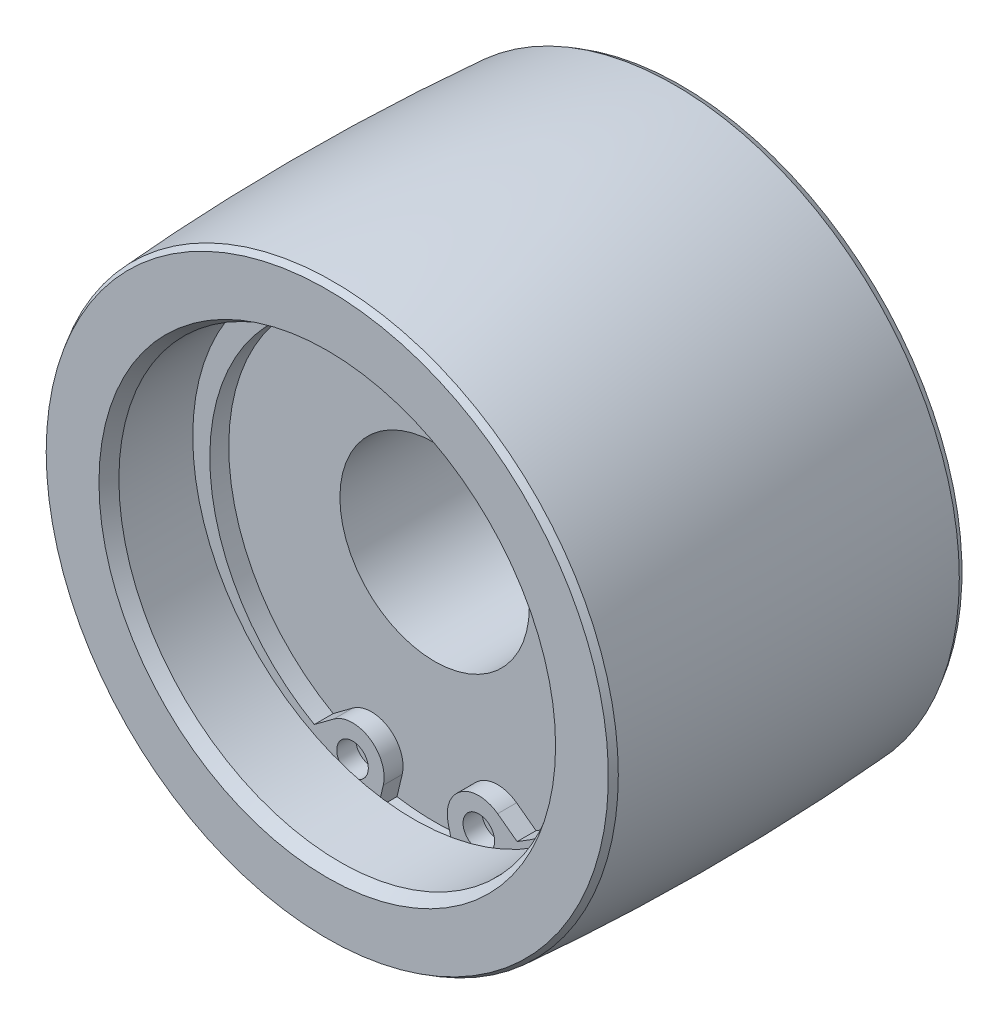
ISO-10303-21;
HEADER;
FILE_DESCRIPTION(('STEP AP214'),'2;1');
FILE_NAME('part.step','',(''),(''),'','','');
FILE_SCHEMA(('AUTOMOTIVE_DESIGN { 1 0 10303 214 1 1 1 1 }'));
ENDSEC;
DATA;
#1=APPLICATION_CONTEXT('core data for automotive mechanical design processes');
#2=APPLICATION_PROTOCOL_DEFINITION('international standard','automotive_design',2000,#1);
#3=PRODUCT_CONTEXT('',#1,'mechanical');
#4=PRODUCT('Part','Part','',(#3));
#5=PRODUCT_RELATED_PRODUCT_CATEGORY('part','',(#4));
#6=PRODUCT_DEFINITION_FORMATION('','',#4);
#7=PRODUCT_DEFINITION_CONTEXT('part definition',#1,'design');
#8=PRODUCT_DEFINITION('design','',#6,#7);
#9=PRODUCT_DEFINITION_SHAPE('','',#8);
#10=(LENGTH_UNIT() NAMED_UNIT(*) SI_UNIT(.MILLI.,.METRE.));
#11=(NAMED_UNIT(*) PLANE_ANGLE_UNIT() SI_UNIT($,.RADIAN.));
#12=(NAMED_UNIT(*) SI_UNIT($,.STERADIAN.) SOLID_ANGLE_UNIT());
#13=UNCERTAINTY_MEASURE_WITH_UNIT(LENGTH_MEASURE(1.E-05),#10,'distance_accuracy_value','');
#14=(GEOMETRIC_REPRESENTATION_CONTEXT(3) GLOBAL_UNCERTAINTY_ASSIGNED_CONTEXT((#13)) GLOBAL_UNIT_ASSIGNED_CONTEXT((#10,
#11,#12)) REPRESENTATION_CONTEXT('',''));
#15=CARTESIAN_POINT('',(0.,0.,0.));
#16=DIRECTION('',(0.,0.,1.));
#17=DIRECTION('',(1.,0.,0.));
#18=AXIS2_PLACEMENT_3D('',#15,#16,#17);
#19=CARTESIAN_POINT('',(0.,-0.9,7.1));
#20=DIRECTION('',(0.,0.,1.));
#21=DIRECTION('',(-1.,0.,0.));
#22=AXIS2_PLACEMENT_3D('',#19,#20,#21);
#23=CYLINDRICAL_SURFACE('',#22,16.3);
#24=CARTESIAN_POINT('',(0.,-0.9,7.));
#25=DIRECTION('',(0.,0.,1.));
#26=DIRECTION('',(1.,0.,0.));
#27=AXIS2_PLACEMENT_3D('',#24,#25,#26);
#28=CIRCLE('',#27,16.3);
#29=CARTESIAN_POINT('',(-8.02922574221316,-15.0852576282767,7.));
#30=VERTEX_POINT('',#29);
#31=CARTESIAN_POINT('',(8.02922574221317,-15.0852576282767,7.));
#32=VERTEX_POINT('',#31);
#33=EDGE_CURVE('E212',#30,#32,#28,.F.);
#34=ORIENTED_EDGE('',*,*,#33,.F.);
#35=DIRECTION('',(0.,0.,-1.));
#36=VECTOR('',#35,1.);
#37=CARTESIAN_POINT('',(-8.02922574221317,-15.0852576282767,7.1));
#38=LINE('',#37,#36);
#39=CARTESIAN_POINT('',(-8.02922574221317,-15.0852576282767,5.5));
#40=VERTEX_POINT('',#39);
#41=EDGE_CURVE('E168',#30,#40,#38,.T.);
#42=ORIENTED_EDGE('',*,*,#41,.T.);
#43=CARTESIAN_POINT('',(0.,-0.9,5.5));
#44=DIRECTION('',(0.,0.,-1.));
#45=DIRECTION('',(0.,-1.,0.));
#46=AXIS2_PLACEMENT_3D('',#43,#44,#45);
#47=CIRCLE('',#46,16.3);
#48=CARTESIAN_POINT('',(8.02922574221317,-15.0852576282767,5.5));
#49=VERTEX_POINT('',#48);
#50=EDGE_CURVE('E171',#40,#49,#47,.T.);
#51=ORIENTED_EDGE('',*,*,#50,.T.);
#52=DIRECTION('',(0.,0.,-1.));
#53=VECTOR('',#52,1.);
#54=CARTESIAN_POINT('',(8.02922574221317,-15.0852576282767,7.1));
#55=LINE('',#54,#53);
#56=EDGE_CURVE('E164',#32,#49,#55,.T.);
#57=ORIENTED_EDGE('',*,*,#56,.F.);
#58=EDGE_LOOP('',(#34,#42,#51,#57));
#59=FACE_BOUND('',#58,.T.);
#60=ADVANCED_FACE('F14',(#59),#23,.F.);
#61=CARTESIAN_POINT('',(6.49138441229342,-13.9421779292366,7.1));
#62=DIRECTION('',(-0.596553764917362,-0.802573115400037,0.));
#63=DIRECTION('',(-0.802573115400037,0.596553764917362,0.));
#64=AXIS2_PLACEMENT_3D('',#61,#62,#63);
#65=PLANE('',#64);
#66=DIRECTION('',(-0.802573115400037,0.596553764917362,0.));
#67=VECTOR('',#66,1.);
#68=CARTESIAN_POINT('',(6.49138441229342,-13.9421779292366,7.));
#69=LINE('',#68,#67);
#70=CARTESIAN_POINT('',(6.49138441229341,-13.9421779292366,7.));
#71=VERTEX_POINT('',#70);
#72=EDGE_CURVE('E210',#32,#71,#69,.T.);
#73=ORIENTED_EDGE('',*,*,#72,.F.);
#74=ORIENTED_EDGE('',*,*,#56,.T.);
#75=DIRECTION('',(-0.802573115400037,0.596553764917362,0.));
#76=VECTOR('',#75,1.);
#77=CARTESIAN_POINT('',(6.49138441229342,-13.9421779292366,5.5));
#78=LINE('',#77,#76);
#79=CARTESIAN_POINT('',(6.49138441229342,-13.9421779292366,5.5));
#80=VERTEX_POINT('',#79);
#81=EDGE_CURVE('E167',#49,#80,#78,.T.);
#82=ORIENTED_EDGE('',*,*,#81,.T.);
#83=DIRECTION('',(0.,0.,-1.));
#84=VECTOR('',#83,1.);
#85=CARTESIAN_POINT('',(6.49138441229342,-13.9421779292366,7.1));
#86=LINE('',#85,#84);
#87=EDGE_CURVE('E162',#71,#80,#86,.T.);
#88=ORIENTED_EDGE('',*,*,#87,.F.);
#89=EDGE_LOOP('',(#73,#74,#82,#88));
#90=FACE_BOUND('',#89,.T.);
#91=ADVANCED_FACE('F194',(#90),#65,.F.);
#92=CARTESIAN_POINT('',(5.,-15.9486107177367,7.1));
#93=DIRECTION('',(0.,0.,1.));
#94=DIRECTION('',(-1.,0.,0.));
#95=AXIS2_PLACEMENT_3D('',#92,#93,#94);
#96=CYLINDRICAL_SURFACE('',#95,2.5);
#97=DIRECTION('',(0.,0.,-1.));
#98=VECTOR('',#97,1.);
#99=CARTESIAN_POINT('',(2.5678231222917,-16.526983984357,7.1));
#100=LINE('',#99,#98);
#101=CARTESIAN_POINT('',(2.5678231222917,-16.526983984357,7.));
#102=VERTEX_POINT('',#101);
#103=CARTESIAN_POINT('',(2.5678231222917,-16.526983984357,5.5));
#104=VERTEX_POINT('',#103);
#105=EDGE_CURVE('E174',#102,#104,#100,.T.);
#106=ORIENTED_EDGE('',*,*,#105,.F.);
#107=CARTESIAN_POINT('',(5.,-15.9486107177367,7.));
#108=DIRECTION('',(0.,0.,1.));
#109=DIRECTION('',(1.,0.,0.));
#110=AXIS2_PLACEMENT_3D('',#107,#108,#109);
#111=CIRCLE('',#110,2.5);
#112=EDGE_CURVE('E209',#102,#71,#111,.F.);
#113=ORIENTED_EDGE('',*,*,#112,.T.);
#114=ORIENTED_EDGE('',*,*,#87,.T.);
#115=CARTESIAN_POINT('',(5.,-15.9486107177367,5.5));
#116=DIRECTION('',(0.,0.,1.));
#117=DIRECTION('',(1.,0.,0.));
#118=AXIS2_PLACEMENT_3D('',#115,#116,#117);
#119=CIRCLE('',#118,2.5);
#120=EDGE_CURVE('E113',#80,#104,#119,.T.);
#121=ORIENTED_EDGE('',*,*,#120,.T.);
#122=EDGE_LOOP('',(#106,#113,#114,#121));
#123=FACE_BOUND('',#122,.T.);
#124=ADVANCED_FACE('F208',(#123),#96,.T.);
#125=CARTESIAN_POINT('',(-2.56782312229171,-16.526983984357,7.1));
#126=DIRECTION('',(-0.97287075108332,0.231349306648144,0.));
#127=DIRECTION('',(0.,0.,1.));
#128=AXIS2_PLACEMENT_3D('',#125,#126,#127);
#129=PLANE('',#128);
#130=DIRECTION('',(0.231349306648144,0.97287075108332,0.));
#131=VECTOR('',#130,1.);
#132=CARTESIAN_POINT('',(-2.56782312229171,-16.526983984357,7.));
#133=LINE('',#132,#131);
#134=CARTESIAN_POINT('',(-2.97957431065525,-18.2584812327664,7.));
#135=VERTEX_POINT('',#134);
#136=CARTESIAN_POINT('',(-2.5678231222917,-16.526983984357,7.));
#137=VERTEX_POINT('',#136);
#138=EDGE_CURVE('E89',#135,#137,#133,.T.);
#139=ORIENTED_EDGE('',*,*,#138,.F.);
#140=DIRECTION('',(0.,0.,-1.));
#141=VECTOR('',#140,1.);
#142=CARTESIAN_POINT('',(-2.97957431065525,-18.2584812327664,-15.4));
#143=LINE('',#142,#141);
#144=CARTESIAN_POINT('',(-2.97957431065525,-18.2584812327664,5.5));
#145=VERTEX_POINT('',#144);
#146=EDGE_CURVE('E22',#145,#135,#143,.F.);
#147=ORIENTED_EDGE('',*,*,#146,.F.);
#148=DIRECTION('',(0.231349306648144,0.97287075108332,0.));
#149=VECTOR('',#148,1.);
#150=CARTESIAN_POINT('',(-2.56782312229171,-16.526983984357,5.5));
#151=LINE('',#150,#149);
#152=CARTESIAN_POINT('',(-2.56782312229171,-16.526983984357,5.5));
#153=VERTEX_POINT('',#152);
#154=EDGE_CURVE('E35',#145,#153,#151,.T.);
#155=ORIENTED_EDGE('',*,*,#154,.T.);
#156=DIRECTION('',(0.,0.,-1.));
#157=VECTOR('',#156,1.);
#158=CARTESIAN_POINT('',(-2.56782312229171,-16.526983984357,7.1));
#159=LINE('',#158,#157);
#160=EDGE_CURVE('E99',#137,#153,#159,.T.);
#161=ORIENTED_EDGE('',*,*,#160,.F.);
#162=EDGE_LOOP('',(#139,#147,#155,#161));
#163=FACE_BOUND('',#162,.T.);
#164=ADVANCED_FACE('F98',(#163),#129,.F.);
#165=CARTESIAN_POINT('',(-6.49138441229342,-13.9421779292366,7.1));
#166=DIRECTION('',(0.596553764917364,-0.802573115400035,0.));
#167=DIRECTION('',(0.,0.,-1.));
#168=AXIS2_PLACEMENT_3D('',#165,#166,#167);
#169=PLANE('',#168);
#170=DIRECTION('',(-0.802573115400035,-0.596553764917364,0.));
#171=VECTOR('',#170,1.);
#172=CARTESIAN_POINT('',(-6.49138441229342,-13.9421779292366,7.));
#173=LINE('',#172,#171);
#174=CARTESIAN_POINT('',(-6.49138441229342,-13.9421779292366,7.));
#175=VERTEX_POINT('',#174);
#176=EDGE_CURVE('E217',#175,#30,#173,.T.);
#177=ORIENTED_EDGE('',*,*,#176,.F.);
#178=DIRECTION('',(0.,0.,-1.));
#179=VECTOR('',#178,1.);
#180=CARTESIAN_POINT('',(-6.49138441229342,-13.9421779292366,7.1));
#181=LINE('',#180,#179);
#182=CARTESIAN_POINT('',(-6.49138441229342,-13.9421779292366,5.5));
#183=VERTEX_POINT('',#182);
#184=EDGE_CURVE('E109',#175,#183,#181,.T.);
#185=ORIENTED_EDGE('',*,*,#184,.T.);
#186=DIRECTION('',(-0.802573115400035,-0.596553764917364,0.));
#187=VECTOR('',#186,1.);
#188=CARTESIAN_POINT('',(-6.49138441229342,-13.9421779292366,5.5));
#189=LINE('',#188,#187);
#190=EDGE_CURVE('E105',#183,#40,#189,.T.);
#191=ORIENTED_EDGE('',*,*,#190,.T.);
#192=ORIENTED_EDGE('',*,*,#41,.F.);
#193=EDGE_LOOP('',(#177,#185,#191,#192));
#194=FACE_BOUND('',#193,.T.);
#195=ADVANCED_FACE('F232',(#194),#169,.F.);
#196=CARTESIAN_POINT('',(-5.,-15.9486107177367,7.1));
#197=DIRECTION('',(0.,0.,1.));
#198=DIRECTION('',(-1.,0.,0.));
#199=AXIS2_PLACEMENT_3D('',#196,#197,#198);
#200=CYLINDRICAL_SURFACE('',#199,2.5);
#201=ORIENTED_EDGE('',*,*,#184,.F.);
#202=CARTESIAN_POINT('',(-5.,-15.9486107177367,7.));
#203=DIRECTION('',(0.,0.,1.));
#204=DIRECTION('',(1.,0.,0.));
#205=AXIS2_PLACEMENT_3D('',#202,#203,#204);
#206=CIRCLE('',#205,2.5);
#207=EDGE_CURVE('E101',#175,#137,#206,.F.);
#208=ORIENTED_EDGE('',*,*,#207,.T.);
#209=ORIENTED_EDGE('',*,*,#160,.T.);
#210=CARTESIAN_POINT('',(-5.,-15.9486107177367,5.5));
#211=DIRECTION('',(0.,0.,1.));
#212=DIRECTION('',(-1.,0.,0.));
#213=AXIS2_PLACEMENT_3D('',#210,#211,#212);
#214=CIRCLE('',#213,2.5);
#215=EDGE_CURVE('E158',#153,#183,#214,.T.);
#216=ORIENTED_EDGE('',*,*,#215,.T.);
#217=EDGE_LOOP('',(#201,#208,#209,#216));
#218=FACE_BOUND('',#217,.T.);
#219=ADVANCED_FACE('F235',(#218),#200,.T.);
#220=CARTESIAN_POINT('',(2.5678231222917,-16.526983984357,7.1));
#221=DIRECTION('',(0.972870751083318,0.231349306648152,0.));
#222=DIRECTION('',(0.,0.,-1.));
#223=AXIS2_PLACEMENT_3D('',#220,#221,#222);
#224=PLANE('',#223);
#225=DIRECTION('',(0.231349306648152,-0.972870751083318,0.));
#226=VECTOR('',#225,1.);
#227=CARTESIAN_POINT('',(2.5678231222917,-16.526983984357,7.));
#228=LINE('',#227,#226);
#229=CARTESIAN_POINT('',(2.97957431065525,-18.2584812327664,7.));
#230=VERTEX_POINT('',#229);
#231=EDGE_CURVE('E92',#102,#230,#228,.T.);
#232=ORIENTED_EDGE('',*,*,#231,.F.);
#233=ORIENTED_EDGE('',*,*,#105,.T.);
#234=DIRECTION('',(0.231349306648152,-0.972870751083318,0.));
#235=VECTOR('',#234,1.);
#236=CARTESIAN_POINT('',(2.5678231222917,-16.526983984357,5.5));
#237=LINE('',#236,#235);
#238=CARTESIAN_POINT('',(2.97957431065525,-18.2584812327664,5.5));
#239=VERTEX_POINT('',#238);
#240=EDGE_CURVE('E172',#104,#239,#237,.T.);
#241=ORIENTED_EDGE('',*,*,#240,.T.);
#242=DIRECTION('',(0.,0.,-1.));
#243=VECTOR('',#242,1.);
#244=CARTESIAN_POINT('',(2.97957431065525,-18.2584812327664,-15.4));
#245=LINE('',#244,#243);
#246=EDGE_CURVE('E9',#230,#239,#245,.T.);
#247=ORIENTED_EDGE('',*,*,#246,.F.);
#248=EDGE_LOOP('',(#232,#233,#241,#247));
#249=FACE_BOUND('',#248,.T.);
#250=ADVANCED_FACE('F237',(#249),#224,.F.);
#251=CARTESIAN_POINT('',(0.,0.,0.));
#252=DIRECTION('',(0.,0.,-1.));
#253=DIRECTION('',(-1.,0.,0.));
#254=AXIS2_PLACEMENT_3D('',#251,#252,#253);
#255=DEGENERATE_TOROIDAL_SURFACE('',#254,177.,200.,.F.);
#256=CARTESIAN_POINT('',(0.,0.,-13.4999999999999));
#257=DIRECTION('',(0.,0.,-1.));
#258=DIRECTION('',(-1.,0.,0.));
#259=AXIS2_PLACEMENT_3D('',#256,#257,#258);
#260=CIRCLE('',#259,22.5438548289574);
#261=CARTESIAN_POINT('',(-22.5438548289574,0.,-13.4999999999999));
#262=VERTEX_POINT('',#261);
#263=EDGE_CURVE('E115',#262,#262,#260,.F.);
#264=ORIENTED_EDGE('',*,*,#263,.T.);
#265=EDGE_LOOP('',(#264));
#266=FACE_BOUND('',#265,.T.);
#267=CARTESIAN_POINT('',(0.,0.,13.5));
#268=DIRECTION('',(0.,0.,1.));
#269=DIRECTION('',(1.,0.,0.));
#270=AXIS2_PLACEMENT_3D('',#267,#268,#269);
#271=CIRCLE('',#270,22.5438548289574);
#272=CARTESIAN_POINT('',(22.5438548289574,0.,13.5));
#273=VERTEX_POINT('',#272);
#274=EDGE_CURVE('E120',#273,#273,#271,.F.);
#275=ORIENTED_EDGE('',*,*,#274,.T.);
#276=EDGE_LOOP('',(#275));
#277=FACE_BOUND('',#276,.T.);
#278=ADVANCED_FACE('F244',(#266,#277),#255,.F.);
#279=CARTESIAN_POINT('',(0.,0.,14.));
#280=DIRECTION('',(0.,0.,-1.));
#281=DIRECTION('',(-1.,0.,0.));
#282=AXIS2_PLACEMENT_3D('',#279,#280,#281);
#283=CONICAL_SURFACE('',#282,22.2551796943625,0.523598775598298);
#284=CARTESIAN_POINT('',(0.,0.,14.));
#285=DIRECTION('',(0.,0.,-1.));
#286=DIRECTION('',(-1.,0.,0.));
#287=AXIS2_PLACEMENT_3D('',#284,#285,#286);
#288=CIRCLE('',#287,22.2551796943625);
#289=CARTESIAN_POINT('',(-22.2551796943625,0.,14.));
#290=VERTEX_POINT('',#289);
#291=EDGE_CURVE('E119',#290,#290,#288,.T.);
#292=ORIENTED_EDGE('',*,*,#291,.T.);
#293=EDGE_LOOP('',(#292));
#294=FACE_BOUND('',#293,.T.);
#295=ORIENTED_EDGE('',*,*,#274,.F.);
#296=EDGE_LOOP('',(#295));
#297=FACE_BOUND('',#296,.T.);
#298=ADVANCED_FACE('F331',(#294,#297),#283,.T.);
#299=CARTESIAN_POINT('',(0.,0.,-13.));
#300=DIRECTION('',(0.,0.,1.));
#301=DIRECTION('',(1.,0.,0.));
#302=AXIS2_PLACEMENT_3D('',#299,#300,#301);
#303=CONICAL_SURFACE('',#302,22.8325299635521,0.523598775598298);
#304=CARTESIAN_POINT('',(0.,0.,-14.));
#305=DIRECTION('',(0.,0.,-1.));
#306=DIRECTION('',(-1.,0.,0.));
#307=AXIS2_PLACEMENT_3D('',#304,#305,#306);
#308=CIRCLE('',#307,22.2551796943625);
#309=CARTESIAN_POINT('',(-22.2551796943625,0.,-14.));
#310=VERTEX_POINT('',#309);
#311=EDGE_CURVE('E118',#310,#310,#308,.T.);
#312=ORIENTED_EDGE('',*,*,#311,.F.);
#313=EDGE_LOOP('',(#312));
#314=FACE_BOUND('',#313,.T.);
#315=ORIENTED_EDGE('',*,*,#263,.F.);
#316=EDGE_LOOP('',(#315));
#317=FACE_BOUND('',#316,.T.);
#318=ADVANCED_FACE('F341',(#314,#317),#303,.T.);
#319=CARTESIAN_POINT('',(0.,0.,14.));
#320=DIRECTION('',(0.,0.,1.));
#321=DIRECTION('',(1.,0.,0.));
#322=AXIS2_PLACEMENT_3D('',#319,#320,#321);
#323=PLANE('',#322);
#324=ORIENTED_EDGE('',*,*,#291,.F.);
#325=EDGE_LOOP('',(#324));
#326=FACE_BOUND('',#325,.T.);
#327=CARTESIAN_POINT('',(0.,0.,14.));
#328=DIRECTION('',(0.,0.,-1.));
#329=DIRECTION('',(-1.,0.,0.));
#330=AXIS2_PLACEMENT_3D('',#327,#328,#329);
#331=CIRCLE('',#330,18.0773502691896);
#332=CARTESIAN_POINT('',(-18.0773502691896,0.,14.));
#333=VERTEX_POINT('',#332);
#334=EDGE_CURVE('E123',#333,#333,#331,.T.);
#335=ORIENTED_EDGE('',*,*,#334,.T.);
#336=EDGE_LOOP('',(#335));
#337=FACE_BOUND('',#336,.T.);
#338=ADVANCED_FACE('F351',(#326,#337),#323,.T.);
#339=CARTESIAN_POINT('',(0.,0.,-14.));
#340=DIRECTION('',(0.,0.,1.));
#341=DIRECTION('',(1.,0.,0.));
#342=AXIS2_PLACEMENT_3D('',#339,#340,#341);
#343=PLANE('',#342);
#344=ORIENTED_EDGE('',*,*,#311,.T.);
#345=EDGE_LOOP('',(#344));
#346=FACE_BOUND('',#345,.T.);
#347=CARTESIAN_POINT('',(0.,0.,-14.));
#348=DIRECTION('',(0.,0.,-1.));
#349=DIRECTION('',(-1.,0.,0.));
#350=AXIS2_PLACEMENT_3D('',#347,#348,#349);
#351=CIRCLE('',#350,14.5);
#352=CARTESIAN_POINT('',(-14.5,0.,-14.));
#353=VERTEX_POINT('',#352);
#354=EDGE_CURVE('E124',#353,#353,#351,.T.);
#355=ORIENTED_EDGE('',*,*,#354,.F.);
#356=EDGE_LOOP('',(#355));
#357=FACE_BOUND('',#356,.T.);
#358=ADVANCED_FACE('F361',(#346,#357),#343,.F.);
#359=CARTESIAN_POINT('',(0.,0.,13.));
#360=DIRECTION('',(0.,0.,1.));
#361=DIRECTION('',(1.,0.,0.));
#362=AXIS2_PLACEMENT_3D('',#359,#360,#361);
#363=CONICAL_SURFACE('',#362,17.5,0.523598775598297);
#364=ORIENTED_EDGE('',*,*,#334,.F.);
#365=EDGE_LOOP('',(#364));
#366=FACE_BOUND('',#365,.T.);
#367=CARTESIAN_POINT('',(0.,0.,13.));
#368=DIRECTION('',(0.,0.,-1.));
#369=DIRECTION('',(-1.,0.,0.));
#370=AXIS2_PLACEMENT_3D('',#367,#368,#369);
#371=CIRCLE('',#370,17.5);
#372=CARTESIAN_POINT('',(-17.5,0.,13.));
#373=VERTEX_POINT('',#372);
#374=EDGE_CURVE('E129',#373,#373,#371,.T.);
#375=ORIENTED_EDGE('',*,*,#374,.T.);
#376=EDGE_LOOP('',(#375));
#377=FACE_BOUND('',#376,.T.);
#378=ADVANCED_FACE('F371',(#366,#377),#363,.F.);
#379=CARTESIAN_POINT('',(0.,0.,-15.4));
#380=DIRECTION('',(0.,0.,-1.));
#381=DIRECTION('',(-1.,0.,0.));
#382=AXIS2_PLACEMENT_3D('',#379,#380,#381);
#383=CYLINDRICAL_SURFACE('',#382,14.5);
#384=CARTESIAN_POINT('',(0.,0.,-5.5));
#385=DIRECTION('',(0.,0.,1.));
#386=DIRECTION('',(1.,0.,0.));
#387=AXIS2_PLACEMENT_3D('',#384,#385,#386);
#388=CIRCLE('',#387,14.5);
#389=CARTESIAN_POINT('',(14.5,0.,-5.5));
#390=VERTEX_POINT('',#389);
#391=EDGE_CURVE('E127',#390,#390,#388,.T.);
#392=ORIENTED_EDGE('',*,*,#391,.T.);
#393=EDGE_LOOP('',(#392));
#394=FACE_BOUND('',#393,.T.);
#395=ORIENTED_EDGE('',*,*,#354,.T.);
#396=EDGE_LOOP('',(#395));
#397=FACE_BOUND('',#396,.T.);
#398=ADVANCED_FACE('F380',(#394,#397),#383,.F.);
#399=CARTESIAN_POINT('',(0.,0.,-15.4));
#400=DIRECTION('',(0.,0.,-1.));
#401=DIRECTION('',(-1.,0.,0.));
#402=AXIS2_PLACEMENT_3D('',#399,#400,#401);
#403=CYLINDRICAL_SURFACE('',#402,17.5);
#404=ORIENTED_EDGE('',*,*,#374,.F.);
#405=EDGE_LOOP('',(#404));
#406=FACE_BOUND('',#405,.T.);
#407=CARTESIAN_POINT('',(0.,0.,7.15));
#408=DIRECTION('',(0.,0.,-1.));
#409=DIRECTION('',(-1.,0.,0.));
#410=AXIS2_PLACEMENT_3D('',#407,#408,#409);
#411=CIRCLE('',#410,17.5);
#412=CARTESIAN_POINT('',(-17.5,0.,7.15));
#413=VERTEX_POINT('',#412);
#414=EDGE_CURVE('E478',#413,#413,#411,.T.);
#415=ORIENTED_EDGE('',*,*,#414,.T.);
#416=EDGE_LOOP('',(#415));
#417=FACE_BOUND('',#416,.T.);
#418=ADVANCED_FACE('F390',(#406,#417),#403,.F.);
#419=CARTESIAN_POINT('',(0.,8.13513866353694,-5.5));
#420=DIRECTION('',(0.,0.,-1.));
#421=DIRECTION('',(-1.,0.,0.));
#422=AXIS2_PLACEMENT_3D('',#419,#420,#421);
#423=PLANE('',#422);
#424=CARTESIAN_POINT('',(0.,0.,-5.5));
#425=DIRECTION('',(0.,0.,1.));
#426=DIRECTION('',(1.,0.,0.));
#427=AXIS2_PLACEMENT_3D('',#424,#425,#426);
#428=CIRCLE('',#427,7.5);
#429=CARTESIAN_POINT('',(7.5,0.,-5.5));
#430=VERTEX_POINT('',#429);
#431=EDGE_CURVE('E143',#430,#430,#428,.T.);
#432=ORIENTED_EDGE('',*,*,#431,.T.);
#433=EDGE_LOOP('',(#432));
#434=FACE_BOUND('',#433,.T.);
#435=ORIENTED_EDGE('',*,*,#391,.F.);
#436=EDGE_LOOP('',(#435));
#437=FACE_BOUND('',#436,.T.);
#438=ADVANCED_FACE('F401',(#434,#437),#423,.T.);
#439=CARTESIAN_POINT('',(0.,0.,-15.4));
#440=DIRECTION('',(0.,0.,-1.));
#441=DIRECTION('',(-1.,0.,0.));
#442=AXIS2_PLACEMENT_3D('',#439,#440,#441);
#443=CYLINDRICAL_SURFACE('',#442,18.5);
#444=CARTESIAN_POINT('',(0.,0.,7.15));
#445=DIRECTION('',(0.,0.,-1.));
#446=DIRECTION('',(-1.,0.,0.));
#447=AXIS2_PLACEMENT_3D('',#444,#445,#446);
#448=CIRCLE('',#447,18.5);
#449=CARTESIAN_POINT('',(-18.5,0.,7.15));
#450=VERTEX_POINT('',#449);
#451=EDGE_CURVE('E94',#450,#450,#448,.T.);
#452=ORIENTED_EDGE('',*,*,#451,.F.);
#453=EDGE_LOOP('',(#452));
#454=FACE_BOUND('',#453,.T.);
#455=CARTESIAN_POINT('',(0.,0.,7.));
#456=DIRECTION('',(0.,0.,1.));
#457=DIRECTION('',(1.,0.,0.));
#458=AXIS2_PLACEMENT_3D('',#455,#456,#457);
#459=CIRCLE('',#458,18.5);
#460=EDGE_CURVE('E85',#230,#135,#459,.T.);
#461=ORIENTED_EDGE('',*,*,#460,.F.);
#462=ORIENTED_EDGE('',*,*,#246,.T.);
#463=CARTESIAN_POINT('',(0.,0.,5.5));
#464=DIRECTION('',(0.,0.,-1.));
#465=DIRECTION('',(-1.,0.,0.));
#466=AXIS2_PLACEMENT_3D('',#463,#464,#465);
#467=CIRCLE('',#466,18.5);
#468=EDGE_CURVE('E104',#239,#145,#467,.T.);
#469=ORIENTED_EDGE('',*,*,#468,.T.);
#470=ORIENTED_EDGE('',*,*,#146,.T.);
#471=EDGE_LOOP('',(#461,#462,#469,#470));
#472=FACE_BOUND('',#471,.T.);
#473=ADVANCED_FACE('F103',(#454,#472),#443,.F.);
#474=CARTESIAN_POINT('',(0.,0.,-44.5));
#475=DIRECTION('',(0.,0.,1.));
#476=DIRECTION('',(1.,0.,0.));
#477=AXIS2_PLACEMENT_3D('',#474,#475,#476);
#478=CYLINDRICAL_SURFACE('',#477,7.5);
#479=ORIENTED_EDGE('',*,*,#431,.F.);
#480=EDGE_LOOP('',(#479));
#481=FACE_BOUND('',#480,.T.);
#482=CARTESIAN_POINT('',(0.,0.,5.5));
#483=DIRECTION('',(0.,0.,1.));
#484=DIRECTION('',(1.,0.,0.));
#485=AXIS2_PLACEMENT_3D('',#482,#483,#484);
#486=CIRCLE('',#485,7.5);
#487=CARTESIAN_POINT('',(7.5,0.,5.5));
#488=VERTEX_POINT('',#487);
#489=EDGE_CURVE('E138',#488,#488,#486,.T.);
#490=ORIENTED_EDGE('',*,*,#489,.T.);
#491=EDGE_LOOP('',(#490));
#492=FACE_BOUND('',#491,.T.);
#493=ADVANCED_FACE('F284',(#481,#492),#478,.F.);
#494=CARTESIAN_POINT('',(0.,20.1822231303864,5.5));
#495=DIRECTION('',(0.,0.,1.));
#496=DIRECTION('',(1.,0.,0.));
#497=AXIS2_PLACEMENT_3D('',#494,#495,#496);
#498=PLANE('',#497);
#499=ORIENTED_EDGE('',*,*,#489,.F.);
#500=EDGE_LOOP('',(#499));
#501=FACE_BOUND('',#500,.T.);
#502=ORIENTED_EDGE('',*,*,#240,.F.);
#503=ORIENTED_EDGE('',*,*,#120,.F.);
#504=ORIENTED_EDGE('',*,*,#81,.F.);
#505=ORIENTED_EDGE('',*,*,#50,.F.);
#506=ORIENTED_EDGE('',*,*,#190,.F.);
#507=ORIENTED_EDGE('',*,*,#215,.F.);
#508=ORIENTED_EDGE('',*,*,#154,.F.);
#509=ORIENTED_EDGE('',*,*,#468,.F.);
#510=EDGE_LOOP('',(#502,#503,#504,#505,#506,#507,#508,#509));
#511=FACE_BOUND('',#510,.T.);
#512=ADVANCED_FACE('F16',(#501,#511),#498,.T.);
#513=CARTESIAN_POINT('',(0.,0.,7.));
#514=DIRECTION('',(0.,0.,1.));
#515=DIRECTION('',(1.,0.,0.));
#516=AXIS2_PLACEMENT_3D('',#513,#514,#515);
#517=PLANE('',#516);
#518=ORIENTED_EDGE('',*,*,#138,.T.);
#519=ORIENTED_EDGE('',*,*,#207,.F.);
#520=ORIENTED_EDGE('',*,*,#176,.T.);
#521=ORIENTED_EDGE('',*,*,#33,.T.);
#522=ORIENTED_EDGE('',*,*,#72,.T.);
#523=ORIENTED_EDGE('',*,*,#112,.F.);
#524=ORIENTED_EDGE('',*,*,#231,.T.);
#525=ORIENTED_EDGE('',*,*,#460,.T.);
#526=EDGE_LOOP('',(#518,#519,#520,#521,#522,#523,#524,#525));
#527=FACE_BOUND('',#526,.T.);
#528=CARTESIAN_POINT('',(-5.,-15.9486107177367,7.));
#529=DIRECTION('',(0.,0.,1.));
#530=DIRECTION('',(1.,0.,0.));
#531=AXIS2_PLACEMENT_3D('',#528,#529,#530);
#532=CIRCLE('',#531,1.25);
#533=CARTESIAN_POINT('',(-3.75,-15.9486107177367,7.));
#534=VERTEX_POINT('',#533);
#535=EDGE_CURVE('E100',#534,#534,#532,.F.);
#536=ORIENTED_EDGE('',*,*,#535,.T.);
#537=EDGE_LOOP('',(#536));
#538=FACE_BOUND('',#537,.T.);
#539=CARTESIAN_POINT('',(5.,-15.9486107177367,7.));
#540=DIRECTION('',(0.,0.,1.));
#541=DIRECTION('',(1.,0.,0.));
#542=AXIS2_PLACEMENT_3D('',#539,#540,#541);
#543=CIRCLE('',#542,1.25);
#544=CARTESIAN_POINT('',(6.25,-15.9486107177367,7.));
#545=VERTEX_POINT('',#544);
#546=EDGE_CURVE('E141',#545,#545,#543,.F.);
#547=ORIENTED_EDGE('',*,*,#546,.T.);
#548=EDGE_LOOP('',(#547));
#549=FACE_BOUND('',#548,.T.);
#550=ADVANCED_FACE('F87',(#527,#538,#549),#517,.T.);
#551=CARTESIAN_POINT('',(-5.,-15.9486107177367,5.5));
#552=DIRECTION('',(0.,0.,-1.));
#553=DIRECTION('',(1.,0.,0.));
#554=AXIS2_PLACEMENT_3D('',#551,#552,#553);
#555=CIRCLE('',#554,1.25);
#556=CARTESIAN_POINT('',(-3.75,-15.9486107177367,5.5));
#557=VERTEX_POINT('',#556);
#558=EDGE_CURVE('E145',#557,#557,#555,.T.);
#559=ORIENTED_EDGE('',*,*,#558,.F.);
#560=EDGE_LOOP('',(#559));
#561=FACE_BOUND('',#560,.T.);
#562=ADVANCED_FACE('F267',(#561),#498,.T.);
#563=CARTESIAN_POINT('',(-5.,-15.9486107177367,7.1));
#564=DIRECTION('',(0.,0.,1.));
#565=DIRECTION('',(-1.,0.,0.));
#566=AXIS2_PLACEMENT_3D('',#563,#564,#565);
#567=CYLINDRICAL_SURFACE('',#566,1.25);
#568=ORIENTED_EDGE('',*,*,#558,.T.);
#569=EDGE_LOOP('',(#568));
#570=FACE_BOUND('',#569,.T.);
#571=ORIENTED_EDGE('',*,*,#535,.F.);
#572=EDGE_LOOP('',(#571));
#573=FACE_BOUND('',#572,.T.);
#574=ADVANCED_FACE('F265',(#570,#573),#567,.F.);
#575=CARTESIAN_POINT('',(5.,-15.9486107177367,5.5));
#576=DIRECTION('',(0.,0.,1.));
#577=DIRECTION('',(1.,0.,0.));
#578=AXIS2_PLACEMENT_3D('',#575,#576,#577);
#579=CIRCLE('',#578,1.25);
#580=CARTESIAN_POINT('',(6.25,-15.9486107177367,5.5));
#581=VERTEX_POINT('',#580);
#582=EDGE_CURVE('E177',#581,#581,#579,.T.);
#583=ORIENTED_EDGE('',*,*,#582,.T.);
#584=EDGE_LOOP('',(#583));
#585=FACE_BOUND('',#584,.T.);
#586=ADVANCED_FACE('F263',(#585),#498,.T.);
#587=CARTESIAN_POINT('',(5.,-15.9486107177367,7.1));
#588=DIRECTION('',(0.,0.,1.));
#589=DIRECTION('',(-1.,0.,0.));
#590=AXIS2_PLACEMENT_3D('',#587,#588,#589);
#591=CYLINDRICAL_SURFACE('',#590,1.25);
#592=ORIENTED_EDGE('',*,*,#582,.F.);
#593=EDGE_LOOP('',(#592));
#594=FACE_BOUND('',#593,.T.);
#595=ORIENTED_EDGE('',*,*,#546,.F.);
#596=EDGE_LOOP('',(#595));
#597=FACE_BOUND('',#596,.T.);
#598=ADVANCED_FACE('F260',(#594,#597),#591,.F.);
#599=CARTESIAN_POINT('',(0.,0.,7.15));
#600=DIRECTION('',(0.,0.,-1.));
#601=DIRECTION('',(-1.,0.,0.));
#602=AXIS2_PLACEMENT_3D('',#599,#600,#601);
#603=PLANE('',#602);
#604=ORIENTED_EDGE('',*,*,#451,.T.);
#605=EDGE_LOOP('',(#604));
#606=FACE_BOUND('',#605,.T.);
#607=ORIENTED_EDGE('',*,*,#414,.F.);
#608=EDGE_LOOP('',(#607));
#609=FACE_BOUND('',#608,.T.);
#610=ADVANCED_FACE('F262',(#606,#609),#603,.T.);
#611=CLOSED_SHELL('',(#60,#91,#124,#164,#195,#219,#250,#278,#298,#318,#338,#358,#378,#398,#418,
#438,#473,#493,#512,#550,#562,#574,#586,#598,#610));
#612=MANIFOLD_SOLID_BREP('B1',#611);
#613=ADVANCED_BREP_SHAPE_REPRESENTATION('',(#18,#612),#14);
#614=SHAPE_DEFINITION_REPRESENTATION(#9,#613);
ENDSEC;
END-ISO-10303-21;
